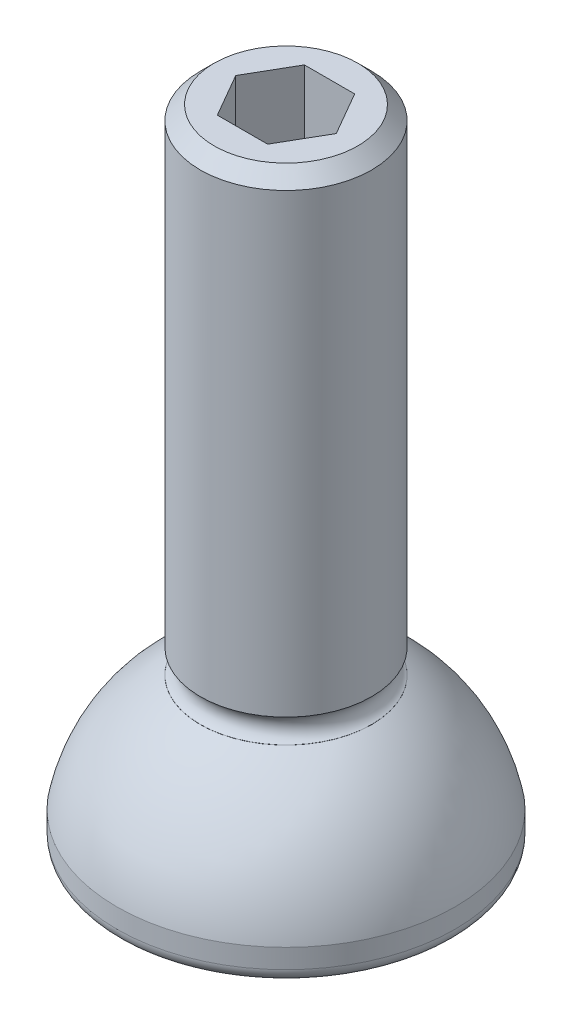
from build123d import *

# Parameters (mm, degrees)
CHAMFER1_SIZE         = 0.762
FILLET1_R             = 0.762
HOLE1_D               = 4.7752
HOLE1_DEPTH           = 6.35
HOLE1_TIP             = 1.434614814
HOLE1_ON_FACE_2_D     = 4.7752
HOLE1_ON_FACE_2_DEPTH = 6.35
HOLE1_ON_FACE_2_TIP   = 1.434614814
CUT_EXTRUDE1_DEPTH    = 4.826
SKETCH5_R             = 0.762


with BuildPart() as part:
    # Sketch1 → Revolve1 (revolve)
    with BuildSketch(Plane.XY):
        with BuildLine():
            Line((0, 0), (9.271, 0))
            Line((9.271, 0), (9.271, 1.824384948))
            ThreePointArc((9.271, 1.824384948), (7.677526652, 5.507758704), (4.699, 8.197513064))
            Line((4.699, 8.197513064), (4.699, 35.306))
            Line((4.699, 35.306), (0, 35.306))
            Line((0, 35.306), (0, 0))
        make_face()
    revolve(axis=Axis((0, -1000, 0), (0, 1, 0)))

    # Chamfer1
    chamfer1_edges = [part.edges().sort_by_distance(p)[0] for p in [
        (-4.699, 35.306, 0),
    ]]
    chamfer(chamfer1_edges, length=CHAMFER1_SIZE)

    # Fillet1
    fillet1_edges = [part.edges().sort_by_distance(p)[0] for p in [
        (-9.271, 0, 0),
    ]]
    fillet(fillet1_edges, radius=FILLET1_R)

    # Hole1
    with Locations(Plane(origin=(0, 35.306, 0), x_dir=(1, 0, 0), z_dir=(0, 1, 0))):
        with Locations((0, 0)):
            Hole(HOLE1_D / 2, depth=HOLE1_DEPTH)
            with Locations((0, 0, -(HOLE1_DEPTH + HOLE1_TIP / 2))):  # 118° drill point
                Cone(0, HOLE1_D / 2, HOLE1_TIP, mode=Mode.SUBTRACT)

    # Hole1 on face 2
    with Locations(Plane(origin=(17.71717461, 0, -13.159625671), x_dir=(1, 0, 0), z_dir=(0, 1, 0))):
        with Locations((0, 0)):
            Hole(HOLE1_ON_FACE_2_D / 2, depth=HOLE1_ON_FACE_2_DEPTH)
            with Locations((0, 0, -(HOLE1_ON_FACE_2_DEPTH + HOLE1_ON_FACE_2_TIP / 2))):  # 118° drill point
                Cone(0, HOLE1_ON_FACE_2_D / 2, HOLE1_ON_FACE_2_TIP, mode=Mode.SUBTRACT)

    # Sketch4 → Cut-Extrude1 (cut)
    with BuildSketch(Plane(origin=(0, 35.306, 0), x_dir=(1, 0, 0), z_dir=(0, 1, 0))):
        Polygon((1.378481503, 2.3876), (-1.378481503, 2.3876), (-2.756963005, 0), (-1.378481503, -2.3876), (1.378481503, -2.3876), (2.756963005, 0), align=None)
    extrude(amount=-CUT_EXTRUDE1_DEPTH, mode=Mode.SUBTRACT)

    # Sketch5 → Cut-Revolve1 (revolve, cut)
    with BuildSketch(Plane.XY):
        with Locations((5.08, 8.8646)):
            Circle(SKETCH5_R)
    revolve(axis=Axis((0, -1000, 0), (0, 1, 0)), mode=Mode.SUBTRACT)


solid = part.part
